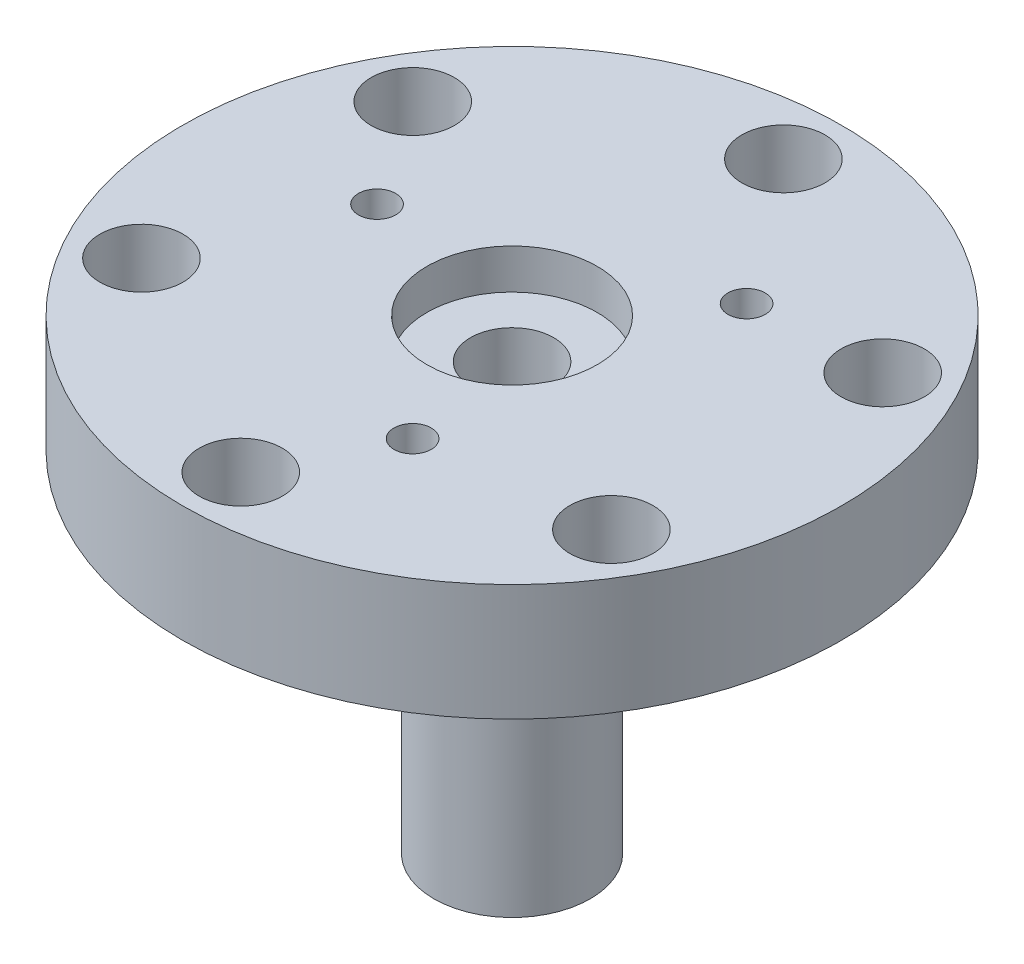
from build123d import *

# Parameters (mm, degrees)
SKETCH2_R          = 1.7272
CUT_EXTRUDE1_DEPTH = 51.290717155
SKETCH3_R          = 3.175
CUT_EXTRUDE2_DEPTH = 5.842
CIRPATTERN1_COUNT  = 6
SKETCH4_R          = 1.1303
CUT_EXTRUDE3_DEPTH = 5.334
SKETCH5_R          = 1.4224
CUT_EXTRUDE4_DEPTH = 4.064
CIRPATTERN2_COUNT  = 3


with BuildPart() as part:
    # Sketch1 → Revolve1 (revolve)
    with BuildSketch(Plane(origin=(0, 0, 0), x_dir=(0, 0, -1), z_dir=(1, 0, 0))):
        Polygon((-6.5024, 0), (-25.146, 0), (-25.146, -8.89), (-10.7188, -8.89), (-10.7188, -7.62), (-8.5852, -7.62), (-8.5852, -8.89), (-5.969, -8.89), (-5.969, -35.56), (-3.175, -35.56), (-3.175, -26.67), (-1.0287, -26.67), (-1.0287, -11.938), (-3.175, -11.938), (-3.175, -3.048), (-6.5024, -3.048), align=None)
    revolve(axis=Axis((0, 21.225283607, 0), (0, -1, 0)))

    # Sketch2 → Cut-Extrude1 (cut, through all)
    with BuildSketch(Plane(origin=(0, 0, 0), x_dir=(-1, 0, 0), z_dir=(0, 1, 0))):
        with Locations(Location((0, 20.701, 0), (0, 0, 90))):
            Circle(SKETCH2_R)
    cut_extrude1 = extrude(amount=-CUT_EXTRUDE1_DEPTH, mode=Mode.SUBTRACT)

    # Sketch3 → Cut-Extrude2 (cut)
    with BuildSketch(Plane(origin=(0, 0, 0), x_dir=(-1, 0, 0), z_dir=(0, 1, 0))):
        with Locations(Location((0, 20.701, 0), (0, 0, 90))):
            Circle(SKETCH3_R)
    cut_extrude2 = extrude(amount=-CUT_EXTRUDE2_DEPTH, mode=Mode.SUBTRACT)

    # CirPattern1: Cut-Extrude1, Cut-Extrude2 ×6 about axis
    cirpattern1_axis = Axis((0, 0, 0), (0, 1, 0))
    add([cut_extrude1.rotate(cirpattern1_axis, i * 360 / CIRPATTERN1_COUNT) for i in range(1, CIRPATTERN1_COUNT)], mode=Mode.SUBTRACT)
    add([cut_extrude2.rotate(cirpattern1_axis, i * 360 / CIRPATTERN1_COUNT) for i in range(1, CIRPATTERN1_COUNT)], mode=Mode.SUBTRACT)

    # Sketch4 → Cut-Extrude3 (cut)
    with BuildSketch(Plane(origin=(0, 0, 0), x_dir=(-1, 0, 0), z_dir=(0, 1, 0))):
        with Locations(Location((-8.163402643, -9.728764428, 0), (0, 0, 90))):
            Circle(SKETCH4_R)
    cut_extrude3 = extrude(amount=-CUT_EXTRUDE3_DEPTH, mode=Mode.SUBTRACT)

    # Sketch5 → Cut-Extrude4 (cut)
    with BuildSketch(Plane(origin=(0, 0, 0), x_dir=(-1, 0, 0), z_dir=(0, 1, 0))):
        with Locations(Location((-8.163402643, -9.728764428, 0), (0, 0, 90))):
            Circle(SKETCH5_R)
    cut_extrude4 = extrude(amount=-CUT_EXTRUDE4_DEPTH, mode=Mode.SUBTRACT)

    # CirPattern2: Cut-Extrude3, Cut-Extrude4 ×3 about axis
    cirpattern2_axis = Axis((0, 0, 0), (0, 1, 0))
    add([cut_extrude3.rotate(cirpattern2_axis, i * 360 / CIRPATTERN2_COUNT) for i in range(1, CIRPATTERN2_COUNT)], mode=Mode.SUBTRACT)
    add([cut_extrude4.rotate(cirpattern2_axis, i * 360 / CIRPATTERN2_COUNT) for i in range(1, CIRPATTERN2_COUNT)], mode=Mode.SUBTRACT)


solid = part.part
